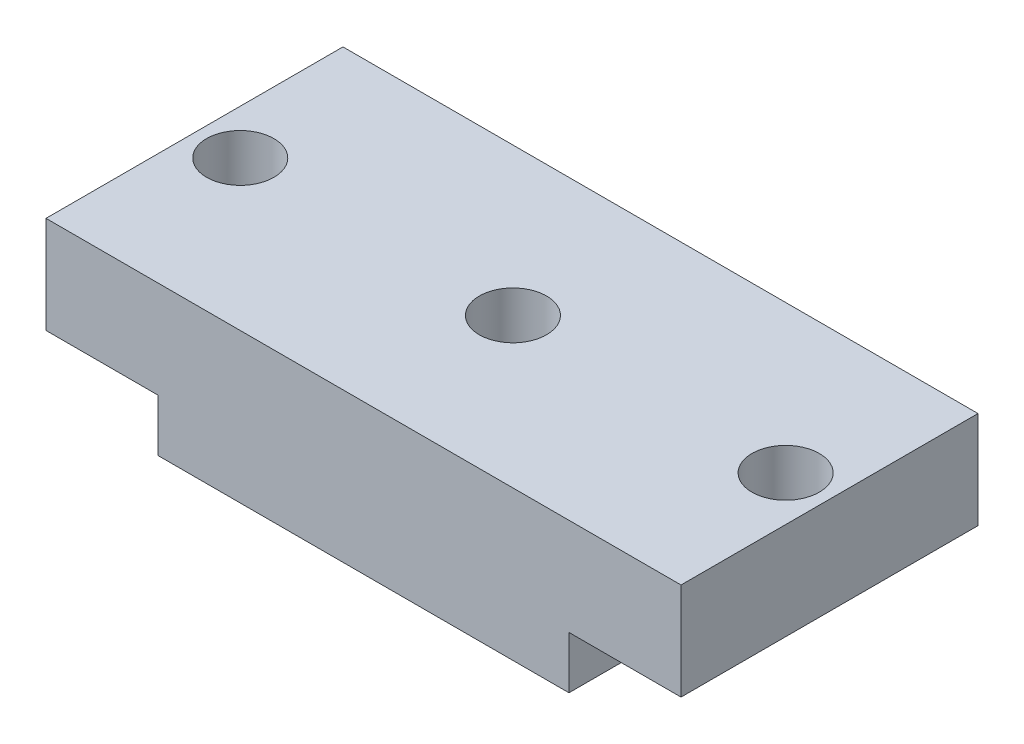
ISO-10303-21;
HEADER;
FILE_DESCRIPTION(('STEP AP214'),'2;1');
FILE_NAME('part.step','',(''),(''),'','','');
FILE_SCHEMA(('AUTOMOTIVE_DESIGN { 1 0 10303 214 1 1 1 1 }'));
ENDSEC;
DATA;
#1=APPLICATION_CONTEXT('core data for automotive mechanical design processes');
#2=APPLICATION_PROTOCOL_DEFINITION('international standard','automotive_design',2000,#1);
#3=PRODUCT_CONTEXT('',#1,'mechanical');
#4=PRODUCT('Part','Part','',(#3));
#5=PRODUCT_RELATED_PRODUCT_CATEGORY('part','',(#4));
#6=PRODUCT_DEFINITION_FORMATION('','',#4);
#7=PRODUCT_DEFINITION_CONTEXT('part definition',#1,'design');
#8=PRODUCT_DEFINITION('design','',#6,#7);
#9=PRODUCT_DEFINITION_SHAPE('','',#8);
#10=(LENGTH_UNIT() NAMED_UNIT(*) SI_UNIT(.MILLI.,.METRE.));
#11=(NAMED_UNIT(*) PLANE_ANGLE_UNIT() SI_UNIT($,.RADIAN.));
#12=(NAMED_UNIT(*) SI_UNIT($,.STERADIAN.) SOLID_ANGLE_UNIT());
#13=UNCERTAINTY_MEASURE_WITH_UNIT(LENGTH_MEASURE(1.E-05),#10,'distance_accuracy_value','');
#14=(GEOMETRIC_REPRESENTATION_CONTEXT(3) GLOBAL_UNCERTAINTY_ASSIGNED_CONTEXT((#13)) GLOBAL_UNIT_ASSIGNED_CONTEXT((#10,
#11,#12)) REPRESENTATION_CONTEXT('',''));
#15=CARTESIAN_POINT('',(0.,0.,0.));
#16=DIRECTION('',(0.,0.,1.));
#17=DIRECTION('',(1.,0.,0.));
#18=AXIS2_PLACEMENT_3D('',#15,#16,#17);
#19=CARTESIAN_POINT('',(-97.4839335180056,36.7807479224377,60.));
#20=DIRECTION('',(1.,0.,0.));
#21=DIRECTION('',(0.,0.,-1.));
#22=AXIS2_PLACEMENT_3D('',#19,#20,#21);
#23=PLANE('',#22);
#24=DIRECTION('',(0.,-1.,0.));
#25=VECTOR('',#24,1.);
#26=CARTESIAN_POINT('',(-97.4839335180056,36.7807479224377,-19.4999999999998));
#27=LINE('',#26,#25);
#28=CARTESIAN_POINT('',(-97.4839335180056,36.7807479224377,-19.4999999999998));
#29=VERTEX_POINT('',#28);
#30=CARTESIAN_POINT('',(-97.4839335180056,10.7807479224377,-19.4999999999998));
#31=VERTEX_POINT('',#30);
#32=EDGE_CURVE('E168',#29,#31,#27,.T.);
#33=ORIENTED_EDGE('',*,*,#32,.T.);
#34=DIRECTION('',(0.,0.,1.));
#35=VECTOR('',#34,1.);
#36=CARTESIAN_POINT('',(-97.4839335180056,10.7807479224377,-19.9999999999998));
#37=LINE('',#36,#35);
#38=CARTESIAN_POINT('',(-97.4839335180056,10.7807479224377,60.0000000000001));
#39=VERTEX_POINT('',#38);
#40=EDGE_CURVE('E186',#31,#39,#37,.T.);
#41=ORIENTED_EDGE('',*,*,#40,.T.);
#42=DIRECTION('',(0.,-1.,0.));
#43=VECTOR('',#42,1.);
#44=CARTESIAN_POINT('',(-97.4839335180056,36.7807479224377,60.));
#45=LINE('',#44,#43);
#46=CARTESIAN_POINT('',(-97.4839335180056,36.7807479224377,60.));
#47=VERTEX_POINT('',#46);
#48=EDGE_CURVE('E123',#47,#39,#45,.T.);
#49=ORIENTED_EDGE('',*,*,#48,.F.);
#50=DIRECTION('',(0.,0.,-1.));
#51=VECTOR('',#50,1.);
#52=CARTESIAN_POINT('',(-97.4839335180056,36.7807479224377,60.));
#53=LINE('',#52,#51);
#54=EDGE_CURVE('E132',#47,#29,#53,.T.);
#55=ORIENTED_EDGE('',*,*,#54,.T.);
#56=EDGE_LOOP('',(#33,#41,#49,#55));
#57=FACE_BOUND('',#56,.T.);
#58=ADVANCED_FACE('F28',(#57),#23,.F.);
#59=CARTESIAN_POINT('',(-97.4839335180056,-3.21925207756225,60.0000000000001));
#60=DIRECTION('',(0.,1.,0.));
#61=DIRECTION('',(0.,0.,1.));
#62=AXIS2_PLACEMENT_3D('',#59,#60,#61);
#63=PLANE('',#62);
#64=CARTESIAN_POINT('',(-12.4839335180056,-3.21925207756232,20.0000000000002));
#65=DIRECTION('',(0.,1.,0.));
#66=DIRECTION('',(0.,0.,1.));
#67=AXIS2_PLACEMENT_3D('',#64,#65,#66);
#68=CIRCLE('',#67,8.99999999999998);
#69=CARTESIAN_POINT('',(-12.4839335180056,-3.21925207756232,29.0000000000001));
#70=VERTEX_POINT('',#69);
#71=EDGE_CURVE('E249',#70,#70,#68,.T.);
#72=ORIENTED_EDGE('',*,*,#71,.T.);
#73=EDGE_LOOP('',(#72));
#74=FACE_BOUND('',#73,.T.);
#75=DIRECTION('',(0.,0.,1.));
#76=VECTOR('',#75,1.);
#77=CARTESIAN_POINT('',(-67.4839335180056,-3.21925207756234,-20.));
#78=LINE('',#77,#76);
#79=CARTESIAN_POINT('',(-67.4839335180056,-3.21925207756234,-19.2));
#80=VERTEX_POINT('',#79);
#81=CARTESIAN_POINT('',(-67.4839335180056,-3.21925207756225,60.0000000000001));
#82=VERTEX_POINT('',#81);
#83=EDGE_CURVE('E97',#80,#82,#78,.T.);
#84=ORIENTED_EDGE('',*,*,#83,.F.);
#85=DIRECTION('',(1.,0.,0.));
#86=VECTOR('',#85,1.);
#87=CARTESIAN_POINT('',(-97.4839335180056,-3.21925207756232,-19.1999999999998));
#88=LINE('',#87,#86);
#89=CARTESIAN_POINT('',(42.5160664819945,-3.21925207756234,-19.2));
#90=VERTEX_POINT('',#89);
#91=EDGE_CURVE('E147',#80,#90,#88,.T.);
#92=ORIENTED_EDGE('',*,*,#91,.T.);
#93=DIRECTION('',(0.,0.,1.));
#94=VECTOR('',#93,1.);
#95=CARTESIAN_POINT('',(42.5160664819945,-3.21925207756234,-20.));
#96=LINE('',#95,#94);
#97=CARTESIAN_POINT('',(42.5160664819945,-3.21925207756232,60.0000000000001));
#98=VERTEX_POINT('',#97);
#99=EDGE_CURVE('E121',#90,#98,#96,.T.);
#100=ORIENTED_EDGE('',*,*,#99,.T.);
#101=DIRECTION('',(1.,0.,0.));
#102=VECTOR('',#101,1.);
#103=CARTESIAN_POINT('',(-97.4839335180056,-3.21925207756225,60.0000000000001));
#104=LINE('',#103,#102);
#105=EDGE_CURVE('E115',#82,#98,#104,.T.);
#106=ORIENTED_EDGE('',*,*,#105,.F.);
#107=EDGE_LOOP('',(#84,#92,#100,#106));
#108=FACE_BOUND('',#107,.T.);
#109=ADVANCED_FACE('F120',(#74,#108),#63,.F.);
#110=CARTESIAN_POINT('',(72.5160664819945,36.7807479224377,60.));
#111=DIRECTION('',(-1.,0.,0.));
#112=DIRECTION('',(0.,0.,1.));
#113=AXIS2_PLACEMENT_3D('',#110,#111,#112);
#114=PLANE('',#113);
#115=DIRECTION('',(0.,1.,0.));
#116=VECTOR('',#115,1.);
#117=CARTESIAN_POINT('',(72.5160664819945,36.7807479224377,60.));
#118=LINE('',#117,#116);
#119=CARTESIAN_POINT('',(72.5160664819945,10.7807479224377,60.0000000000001));
#120=VERTEX_POINT('',#119);
#121=CARTESIAN_POINT('',(72.5160664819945,36.7807479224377,60.));
#122=VERTEX_POINT('',#121);
#123=EDGE_CURVE('E122',#120,#122,#118,.T.);
#124=ORIENTED_EDGE('',*,*,#123,.F.);
#125=DIRECTION('',(0.,0.,1.));
#126=VECTOR('',#125,1.);
#127=CARTESIAN_POINT('',(72.5160664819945,10.7807479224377,-20.));
#128=LINE('',#127,#126);
#129=CARTESIAN_POINT('',(72.5160664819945,10.7807479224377,-19.5));
#130=VERTEX_POINT('',#129);
#131=EDGE_CURVE('E159',#130,#120,#128,.T.);
#132=ORIENTED_EDGE('',*,*,#131,.F.);
#133=DIRECTION('',(0.,1.,0.));
#134=VECTOR('',#133,1.);
#135=CARTESIAN_POINT('',(72.5160664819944,36.7807479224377,-19.5));
#136=LINE('',#135,#134);
#137=CARTESIAN_POINT('',(72.5160664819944,36.7807479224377,-19.5));
#138=VERTEX_POINT('',#137);
#139=EDGE_CURVE('E171',#130,#138,#136,.T.);
#140=ORIENTED_EDGE('',*,*,#139,.T.);
#141=DIRECTION('',(0.,0.,-1.));
#142=VECTOR('',#141,1.);
#143=CARTESIAN_POINT('',(72.5160664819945,36.7807479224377,60.));
#144=LINE('',#143,#142);
#145=EDGE_CURVE('E134',#122,#138,#144,.T.);
#146=ORIENTED_EDGE('',*,*,#145,.F.);
#147=EDGE_LOOP('',(#124,#132,#140,#146));
#148=FACE_BOUND('',#147,.T.);
#149=ADVANCED_FACE('F191',(#148),#114,.F.);
#150=CARTESIAN_POINT('',(-97.4839335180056,36.7807479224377,60.));
#151=DIRECTION('',(0.,-1.,0.));
#152=DIRECTION('',(0.,0.,-1.));
#153=AXIS2_PLACEMENT_3D('',#150,#151,#152);
#154=PLANE('',#153);
#155=CARTESIAN_POINT('',(-12.4839335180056,36.7807479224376,20.));
#156=DIRECTION('',(0.,1.,0.));
#157=DIRECTION('',(0.,0.,1.));
#158=AXIS2_PLACEMENT_3D('',#155,#156,#157);
#159=CIRCLE('',#158,8.99999999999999);
#160=CARTESIAN_POINT('',(-12.4839335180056,36.7807479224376,29.));
#161=VERTEX_POINT('',#160);
#162=EDGE_CURVE('E246',#161,#161,#159,.T.);
#163=ORIENTED_EDGE('',*,*,#162,.F.);
#164=EDGE_LOOP('',(#163));
#165=FACE_BOUND('',#164,.T.);
#166=CARTESIAN_POINT('',(60.5160664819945,36.7807479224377,20.));
#167=DIRECTION('',(0.,1.,0.));
#168=DIRECTION('',(0.,0.,1.));
#169=AXIS2_PLACEMENT_3D('',#166,#167,#168);
#170=CIRCLE('',#169,8.99999999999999);
#171=CARTESIAN_POINT('',(60.5160664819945,36.7807479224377,29.));
#172=VERTEX_POINT('',#171);
#173=EDGE_CURVE('E154',#172,#172,#170,.T.);
#174=ORIENTED_EDGE('',*,*,#173,.F.);
#175=EDGE_LOOP('',(#174));
#176=FACE_BOUND('',#175,.T.);
#177=CARTESIAN_POINT('',(-85.4839335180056,36.7807479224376,20.));
#178=DIRECTION('',(0.,1.,0.));
#179=DIRECTION('',(0.,0.,1.));
#180=AXIS2_PLACEMENT_3D('',#177,#178,#179);
#181=CIRCLE('',#180,8.99999999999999);
#182=CARTESIAN_POINT('',(-85.4839335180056,36.7807479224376,29.));
#183=VERTEX_POINT('',#182);
#184=EDGE_CURVE('E150',#183,#183,#181,.T.);
#185=ORIENTED_EDGE('',*,*,#184,.F.);
#186=EDGE_LOOP('',(#185));
#187=FACE_BOUND('',#186,.T.);
#188=ORIENTED_EDGE('',*,*,#145,.T.);
#189=DIRECTION('',(-1.,0.,0.));
#190=VECTOR('',#189,1.);
#191=CARTESIAN_POINT('',(-97.4839335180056,36.7807479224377,-19.4999999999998));
#192=LINE('',#191,#190);
#193=EDGE_CURVE('E127',#138,#29,#192,.T.);
#194=ORIENTED_EDGE('',*,*,#193,.T.);
#195=ORIENTED_EDGE('',*,*,#54,.F.);
#196=DIRECTION('',(-1.,0.,0.));
#197=VECTOR('',#196,1.);
#198=CARTESIAN_POINT('',(-97.4839335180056,36.7807479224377,60.));
#199=LINE('',#198,#197);
#200=EDGE_CURVE('E125',#122,#47,#199,.T.);
#201=ORIENTED_EDGE('',*,*,#200,.F.);
#202=EDGE_LOOP('',(#188,#194,#195,#201));
#203=FACE_BOUND('',#202,.T.);
#204=ADVANCED_FACE('F176',(#165,#176,#187,#203),#154,.F.);
#205=CARTESIAN_POINT('',(-97.4839335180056,-3.21925207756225,60.0000000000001));
#206=DIRECTION('',(0.,0.,1.));
#207=DIRECTION('',(1.,0.,0.));
#208=AXIS2_PLACEMENT_3D('',#205,#206,#207);
#209=PLANE('',#208);
#210=DIRECTION('',(-1.,0.,0.));
#211=VECTOR('',#210,1.);
#212=CARTESIAN_POINT('',(-97.4839335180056,10.7807479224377,60.0000000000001));
#213=LINE('',#212,#211);
#214=CARTESIAN_POINT('',(-67.4839335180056,10.7807479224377,60.0000000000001));
#215=VERTEX_POINT('',#214);
#216=EDGE_CURVE('E109',#215,#39,#213,.T.);
#217=ORIENTED_EDGE('',*,*,#216,.F.);
#218=DIRECTION('',(0.,1.,0.));
#219=VECTOR('',#218,1.);
#220=CARTESIAN_POINT('',(-67.4839335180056,10.7807479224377,60.0000000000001));
#221=LINE('',#220,#219);
#222=EDGE_CURVE('E101',#82,#215,#221,.T.);
#223=ORIENTED_EDGE('',*,*,#222,.F.);
#224=ORIENTED_EDGE('',*,*,#105,.T.);
#225=DIRECTION('',(0.,-1.,0.));
#226=VECTOR('',#225,1.);
#227=CARTESIAN_POINT('',(42.5160664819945,10.7807479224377,60.));
#228=LINE('',#227,#226);
#229=CARTESIAN_POINT('',(42.5160664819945,10.7807479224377,60.));
#230=VERTEX_POINT('',#229);
#231=EDGE_CURVE('E158',#230,#98,#228,.T.);
#232=ORIENTED_EDGE('',*,*,#231,.F.);
#233=DIRECTION('',(-1.,0.,0.));
#234=VECTOR('',#233,1.);
#235=CARTESIAN_POINT('',(42.5160664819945,10.7807479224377,60.));
#236=LINE('',#235,#234);
#237=EDGE_CURVE('E160',#120,#230,#236,.T.);
#238=ORIENTED_EDGE('',*,*,#237,.F.);
#239=ORIENTED_EDGE('',*,*,#123,.T.);
#240=ORIENTED_EDGE('',*,*,#200,.T.);
#241=ORIENTED_EDGE('',*,*,#48,.T.);
#242=EDGE_LOOP('',(#217,#223,#224,#232,#238,#239,#240,#241));
#243=FACE_BOUND('',#242,.T.);
#244=ADVANCED_FACE('F113',(#243),#209,.T.);
#245=CARTESIAN_POINT('',(-97.4839335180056,-3.21925207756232,-19.4999999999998));
#246=DIRECTION('',(0.,0.,1.));
#247=DIRECTION('',(1.,0.,0.));
#248=AXIS2_PLACEMENT_3D('',#245,#246,#247);
#249=PLANE('',#248);
#250=DIRECTION('',(0.,-1.,0.));
#251=VECTOR('',#250,1.);
#252=CARTESIAN_POINT('',(42.5160664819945,-3.21925207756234,-19.5));
#253=LINE('',#252,#251);
#254=CARTESIAN_POINT('',(42.5160664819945,10.7807479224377,-19.5));
#255=VERTEX_POINT('',#254);
#256=CARTESIAN_POINT('',(42.5160664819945,-2.91925207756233,-19.5));
#257=VERTEX_POINT('',#256);
#258=EDGE_CURVE('E140',#255,#257,#253,.T.);
#259=ORIENTED_EDGE('',*,*,#258,.T.);
#260=DIRECTION('',(1.,0.,0.));
#261=VECTOR('',#260,1.);
#262=CARTESIAN_POINT('',(-97.4839335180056,-2.91925207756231,-19.4999999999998));
#263=LINE('',#262,#261);
#264=CARTESIAN_POINT('',(-67.4839335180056,-2.91925207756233,-19.5));
#265=VERTEX_POINT('',#264);
#266=EDGE_CURVE('E35',#257,#265,#263,.F.);
#267=ORIENTED_EDGE('',*,*,#266,.T.);
#268=DIRECTION('',(0.,1.,0.));
#269=VECTOR('',#268,1.);
#270=CARTESIAN_POINT('',(-67.4839335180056,-3.21925207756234,-19.5));
#271=LINE('',#270,#269);
#272=CARTESIAN_POINT('',(-67.4839335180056,10.7807479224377,-19.5));
#273=VERTEX_POINT('',#272);
#274=EDGE_CURVE('E142',#265,#273,#271,.T.);
#275=ORIENTED_EDGE('',*,*,#274,.T.);
#276=DIRECTION('',(-1.,0.,0.));
#277=VECTOR('',#276,1.);
#278=CARTESIAN_POINT('',(-97.4839335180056,10.7807479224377,-19.4999999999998));
#279=LINE('',#278,#277);
#280=EDGE_CURVE('E144',#273,#31,#279,.T.);
#281=ORIENTED_EDGE('',*,*,#280,.T.);
#282=ORIENTED_EDGE('',*,*,#32,.F.);
#283=ORIENTED_EDGE('',*,*,#193,.F.);
#284=ORIENTED_EDGE('',*,*,#139,.F.);
#285=DIRECTION('',(-1.,0.,0.));
#286=VECTOR('',#285,1.);
#287=CARTESIAN_POINT('',(-97.4839335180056,10.7807479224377,-19.4999999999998));
#288=LINE('',#287,#286);
#289=EDGE_CURVE('E137',#130,#255,#288,.T.);
#290=ORIENTED_EDGE('',*,*,#289,.T.);
#291=EDGE_LOOP('',(#259,#267,#275,#281,#282,#283,#284,#290));
#292=FACE_BOUND('',#291,.T.);
#293=ADVANCED_FACE('F182',(#292),#249,.F.);
#294=CARTESIAN_POINT('',(42.5160664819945,10.7807479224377,-20.));
#295=DIRECTION('',(-1.,0.,0.));
#296=DIRECTION('',(0.,0.,1.));
#297=AXIS2_PLACEMENT_3D('',#294,#295,#296);
#298=PLANE('',#297);
#299=ORIENTED_EDGE('',*,*,#99,.F.);
#300=CARTESIAN_POINT('',(42.5160664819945,-2.91925207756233,-19.2));
#301=DIRECTION('',(-1.,0.,0.));
#302=DIRECTION('',(0.,0.,1.));
#303=AXIS2_PLACEMENT_3D('',#300,#301,#302);
#304=CIRCLE('',#303,0.3);
#305=EDGE_CURVE('E49',#90,#257,#304,.F.);
#306=ORIENTED_EDGE('',*,*,#305,.T.);
#307=ORIENTED_EDGE('',*,*,#258,.F.);
#308=DIRECTION('',(0.,0.,1.));
#309=VECTOR('',#308,1.);
#310=CARTESIAN_POINT('',(42.5160664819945,10.7807479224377,-20.));
#311=LINE('',#310,#309);
#312=EDGE_CURVE('E162',#255,#230,#311,.T.);
#313=ORIENTED_EDGE('',*,*,#312,.T.);
#314=ORIENTED_EDGE('',*,*,#231,.T.);
#315=EDGE_LOOP('',(#299,#306,#307,#313,#314));
#316=FACE_BOUND('',#315,.T.);
#317=ADVANCED_FACE('F157',(#316),#298,.F.);
#318=CARTESIAN_POINT('',(42.5160664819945,10.7807479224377,-20.));
#319=DIRECTION('',(0.,1.,0.));
#320=DIRECTION('',(0.,0.,1.));
#321=AXIS2_PLACEMENT_3D('',#318,#319,#320);
#322=PLANE('',#321);
#323=CARTESIAN_POINT('',(60.5160664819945,10.7807479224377,20.));
#324=DIRECTION('',(0.,1.,0.));
#325=DIRECTION('',(0.,0.,1.));
#326=AXIS2_PLACEMENT_3D('',#323,#324,#325);
#327=CIRCLE('',#326,8.99999999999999);
#328=CARTESIAN_POINT('',(60.5160664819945,10.7807479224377,29.));
#329=VERTEX_POINT('',#328);
#330=EDGE_CURVE('E151',#329,#329,#327,.T.);
#331=ORIENTED_EDGE('',*,*,#330,.T.);
#332=EDGE_LOOP('',(#331));
#333=FACE_BOUND('',#332,.T.);
#334=ORIENTED_EDGE('',*,*,#131,.T.);
#335=ORIENTED_EDGE('',*,*,#237,.T.);
#336=ORIENTED_EDGE('',*,*,#312,.F.);
#337=ORIENTED_EDGE('',*,*,#289,.F.);
#338=EDGE_LOOP('',(#334,#335,#336,#337));
#339=FACE_BOUND('',#338,.T.);
#340=ADVANCED_FACE('F193',(#333,#339),#322,.F.);
#341=CARTESIAN_POINT('',(-97.4839335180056,10.7807479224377,-19.9999999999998));
#342=DIRECTION('',(0.,1.,0.));
#343=DIRECTION('',(-1.,0.,0.));
#344=AXIS2_PLACEMENT_3D('',#341,#342,#343);
#345=PLANE('',#344);
#346=CARTESIAN_POINT('',(-85.4839335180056,10.7807479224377,20.));
#347=DIRECTION('',(0.,1.,0.));
#348=DIRECTION('',(-1.,0.,0.));
#349=AXIS2_PLACEMENT_3D('',#346,#347,#348);
#350=CIRCLE('',#349,8.99999999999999);
#351=CARTESIAN_POINT('',(-94.4839335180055,10.7807479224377,20.));
#352=VERTEX_POINT('',#351);
#353=EDGE_CURVE('E118',#352,#352,#350,.T.);
#354=ORIENTED_EDGE('',*,*,#353,.T.);
#355=EDGE_LOOP('',(#354));
#356=FACE_BOUND('',#355,.T.);
#357=DIRECTION('',(0.,0.,1.));
#358=VECTOR('',#357,1.);
#359=CARTESIAN_POINT('',(-67.4839335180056,10.7807479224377,-20.));
#360=LINE('',#359,#358);
#361=EDGE_CURVE('E108',#273,#215,#360,.T.);
#362=ORIENTED_EDGE('',*,*,#361,.T.);
#363=ORIENTED_EDGE('',*,*,#216,.T.);
#364=ORIENTED_EDGE('',*,*,#40,.F.);
#365=ORIENTED_EDGE('',*,*,#280,.F.);
#366=EDGE_LOOP('',(#362,#363,#364,#365));
#367=FACE_BOUND('',#366,.T.);
#368=ADVANCED_FACE('F226',(#356,#367),#345,.F.);
#369=CARTESIAN_POINT('',(-67.4839335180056,10.7807479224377,-20.));
#370=DIRECTION('',(1.,0.,0.));
#371=DIRECTION('',(0.,0.,-1.));
#372=AXIS2_PLACEMENT_3D('',#369,#370,#371);
#373=PLANE('',#372);
#374=ORIENTED_EDGE('',*,*,#274,.F.);
#375=CARTESIAN_POINT('',(-67.4839335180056,-2.91925207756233,-19.2));
#376=DIRECTION('',(1.,0.,0.));
#377=DIRECTION('',(0.,0.,-1.));
#378=AXIS2_PLACEMENT_3D('',#375,#376,#377);
#379=CIRCLE('',#378,0.3);
#380=EDGE_CURVE('E11',#265,#80,#379,.F.);
#381=ORIENTED_EDGE('',*,*,#380,.T.);
#382=ORIENTED_EDGE('',*,*,#83,.T.);
#383=ORIENTED_EDGE('',*,*,#222,.T.);
#384=ORIENTED_EDGE('',*,*,#361,.F.);
#385=EDGE_LOOP('',(#374,#381,#382,#383,#384));
#386=FACE_BOUND('',#385,.T.);
#387=ADVANCED_FACE('F99',(#386),#373,.F.);
#388=CARTESIAN_POINT('',(-85.4839335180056,36.7807479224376,20.));
#389=DIRECTION('',(0.,1.,0.));
#390=DIRECTION('',(0.,0.,1.));
#391=AXIS2_PLACEMENT_3D('',#388,#389,#390);
#392=CYLINDRICAL_SURFACE('',#391,8.99999999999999);
#393=ORIENTED_EDGE('',*,*,#184,.T.);
#394=EDGE_LOOP('',(#393));
#395=FACE_BOUND('',#394,.T.);
#396=ORIENTED_EDGE('',*,*,#353,.F.);
#397=EDGE_LOOP('',(#396));
#398=FACE_BOUND('',#397,.T.);
#399=ADVANCED_FACE('F230',(#395,#398),#392,.F.);
#400=CARTESIAN_POINT('',(60.5160664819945,36.7807479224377,20.));
#401=DIRECTION('',(0.,1.,0.));
#402=DIRECTION('',(0.,0.,1.));
#403=AXIS2_PLACEMENT_3D('',#400,#401,#402);
#404=CYLINDRICAL_SURFACE('',#403,8.99999999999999);
#405=ORIENTED_EDGE('',*,*,#173,.T.);
#406=EDGE_LOOP('',(#405));
#407=FACE_BOUND('',#406,.T.);
#408=ORIENTED_EDGE('',*,*,#330,.F.);
#409=EDGE_LOOP('',(#408));
#410=FACE_BOUND('',#409,.T.);
#411=ADVANCED_FACE('F201',(#407,#410),#404,.F.);
#412=CARTESIAN_POINT('',(-12.4839335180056,36.7807479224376,20.));
#413=DIRECTION('',(0.,1.,0.));
#414=DIRECTION('',(0.,0.,1.));
#415=AXIS2_PLACEMENT_3D('',#412,#413,#414);
#416=CYLINDRICAL_SURFACE('',#415,8.99999999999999);
#417=ORIENTED_EDGE('',*,*,#71,.F.);
#418=EDGE_LOOP('',(#417));
#419=FACE_BOUND('',#418,.T.);
#420=ORIENTED_EDGE('',*,*,#162,.T.);
#421=EDGE_LOOP('',(#420));
#422=FACE_BOUND('',#421,.T.);
#423=ADVANCED_FACE('F196',(#419,#422),#416,.F.);
#424=CARTESIAN_POINT('',(-97.4839335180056,-2.91925207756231,-19.1999999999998));
#425=DIRECTION('',(1.,0.,0.));
#426=DIRECTION('',(0.,0.,-1.));
#427=AXIS2_PLACEMENT_3D('',#424,#425,#426);
#428=CYLINDRICAL_SURFACE('',#427,0.3);
#429=ORIENTED_EDGE('',*,*,#380,.F.);
#430=ORIENTED_EDGE('',*,*,#266,.F.);
#431=ORIENTED_EDGE('',*,*,#305,.F.);
#432=ORIENTED_EDGE('',*,*,#91,.F.);
#433=EDGE_LOOP('',(#429,#430,#431,#432));
#434=FACE_BOUND('',#433,.T.);
#435=ADVANCED_FACE('F194',(#434),#428,.T.);
#436=CLOSED_SHELL('',(#58,#109,#149,#204,#244,#293,#317,#340,#368,#387,#399,#411,#423,#435));
#437=MANIFOLD_SOLID_BREP('B2',#436);
#438=ADVANCED_BREP_SHAPE_REPRESENTATION('',(#18,#437),#14);
#439=SHAPE_DEFINITION_REPRESENTATION(#9,#438);
ENDSEC;
END-ISO-10303-21;
